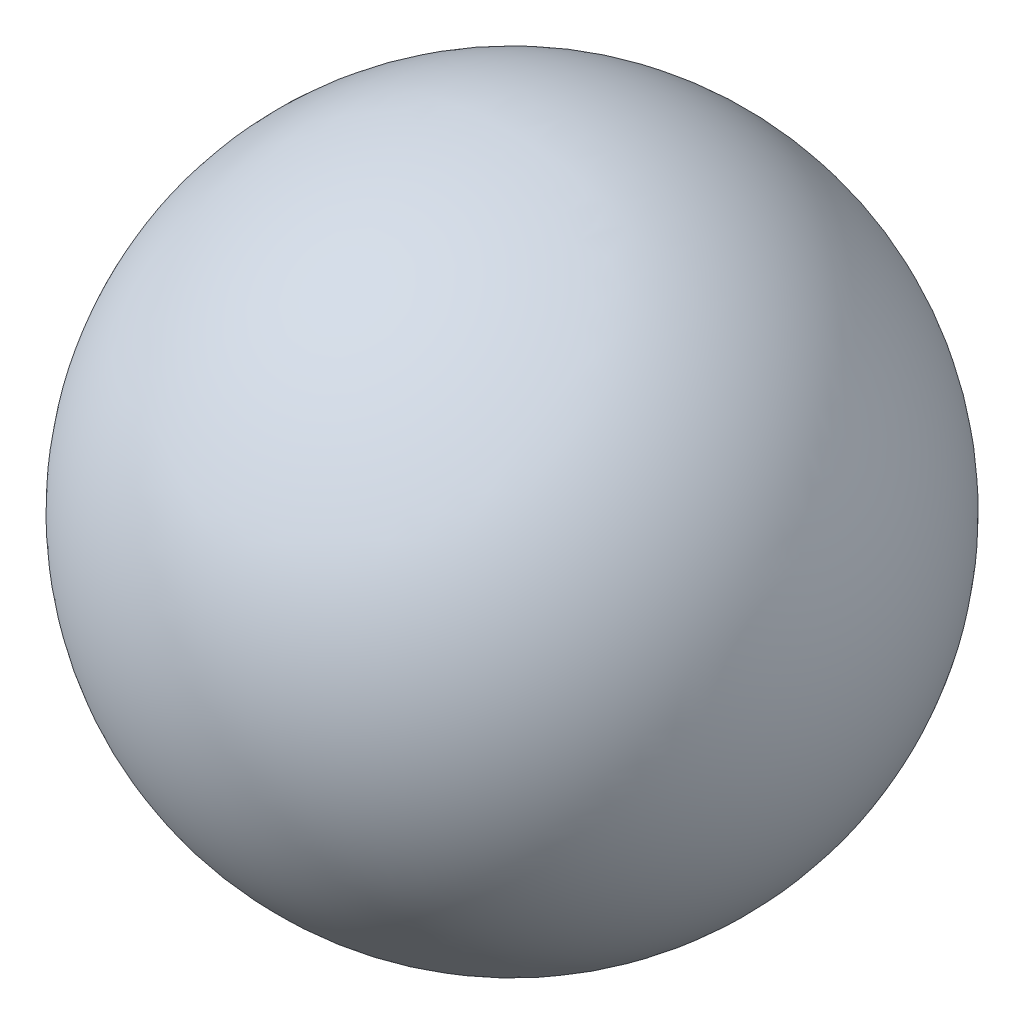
ISO-10303-21;
HEADER;
FILE_DESCRIPTION(('STEP AP214'),'2;1');
FILE_NAME('part.step','',(''),(''),'','','');
FILE_SCHEMA(('AUTOMOTIVE_DESIGN { 1 0 10303 214 1 1 1 1 }'));
ENDSEC;
DATA;
#1=APPLICATION_CONTEXT('core data for automotive mechanical design processes');
#2=APPLICATION_PROTOCOL_DEFINITION('international standard','automotive_design',2000,#1);
#3=PRODUCT_CONTEXT('',#1,'mechanical');
#4=PRODUCT('Part','Part','',(#3));
#5=PRODUCT_RELATED_PRODUCT_CATEGORY('part','',(#4));
#6=PRODUCT_DEFINITION_FORMATION('','',#4);
#7=PRODUCT_DEFINITION_CONTEXT('part definition',#1,'design');
#8=PRODUCT_DEFINITION('design','',#6,#7);
#9=PRODUCT_DEFINITION_SHAPE('','',#8);
#10=(LENGTH_UNIT() NAMED_UNIT(*) SI_UNIT(.MILLI.,.METRE.));
#11=(NAMED_UNIT(*) PLANE_ANGLE_UNIT() SI_UNIT($,.RADIAN.));
#12=(NAMED_UNIT(*) SI_UNIT($,.STERADIAN.) SOLID_ANGLE_UNIT());
#13=UNCERTAINTY_MEASURE_WITH_UNIT(LENGTH_MEASURE(1.E-05),#10,'distance_accuracy_value','');
#14=(GEOMETRIC_REPRESENTATION_CONTEXT(3) GLOBAL_UNCERTAINTY_ASSIGNED_CONTEXT((#13)) GLOBAL_UNIT_ASSIGNED_CONTEXT((#10,
#11,#12)) REPRESENTATION_CONTEXT('',''));
#15=CARTESIAN_POINT('',(0.,0.,0.));
#16=DIRECTION('',(0.,0.,1.));
#17=DIRECTION('',(1.,0.,0.));
#18=AXIS2_PLACEMENT_3D('',#15,#16,#17);
#19=CARTESIAN_POINT('',(0.,14.25,0.));
#20=DIRECTION('',(1.,0.,0.));
#21=DIRECTION('',(0.,1.,0.));
#22=AXIS2_PLACEMENT_3D('',#19,#20,#21);
#23=SPHERICAL_SURFACE('',#22,3.3735);
#24=CARTESIAN_POINT('',(-3.3735,14.25,0.));
#25=VERTEX_POINT('',#24);
#26=VERTEX_LOOP('',#25);
#27=FACE_BOUND('',#26,.T.);
#28=CARTESIAN_POINT('',(3.3735,14.25,0.));
#29=VERTEX_POINT('',#28);
#30=VERTEX_LOOP('',#29);
#31=FACE_BOUND('',#30,.T.);
#32=ADVANCED_FACE('F13',(#27,#31),#23,.T.);
#33=CLOSED_SHELL('',(#32));
#34=MANIFOLD_SOLID_BREP('B1',#33);
#35=ADVANCED_BREP_SHAPE_REPRESENTATION('',(#18,#34),#14);
#36=SHAPE_DEFINITION_REPRESENTATION(#9,#35);
ENDSEC;
END-ISO-10303-21;
